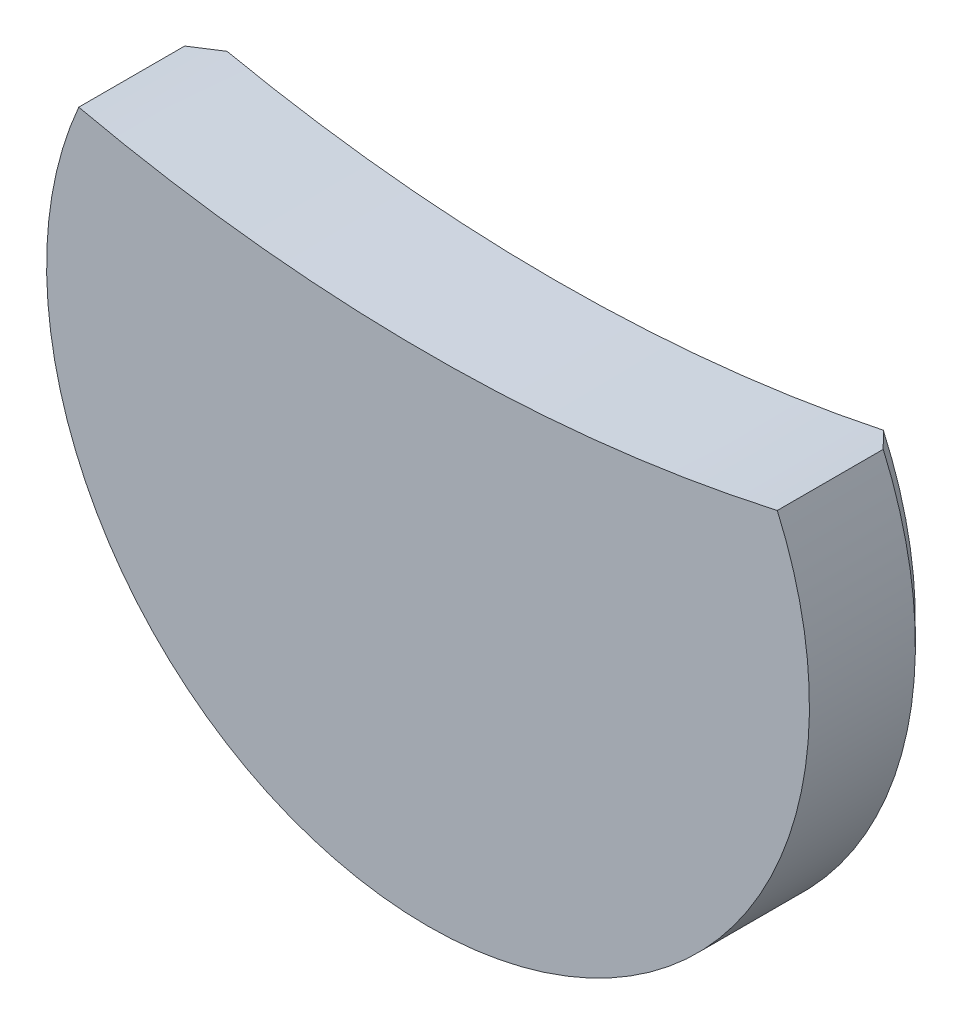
ISO-10303-21;
HEADER;
FILE_DESCRIPTION(('STEP AP214'),'2;1');
FILE_NAME('part.step','',(''),(''),'','','');
FILE_SCHEMA(('AUTOMOTIVE_DESIGN { 1 0 10303 214 1 1 1 1 }'));
ENDSEC;
DATA;
#1=APPLICATION_CONTEXT('core data for automotive mechanical design processes');
#2=APPLICATION_PROTOCOL_DEFINITION('international standard','automotive_design',2000,#1);
#3=PRODUCT_CONTEXT('',#1,'mechanical');
#4=PRODUCT('Part','Part','',(#3));
#5=PRODUCT_RELATED_PRODUCT_CATEGORY('part','',(#4));
#6=PRODUCT_DEFINITION_FORMATION('','',#4);
#7=PRODUCT_DEFINITION_CONTEXT('part definition',#1,'design');
#8=PRODUCT_DEFINITION('design','',#6,#7);
#9=PRODUCT_DEFINITION_SHAPE('','',#8);
#10=(LENGTH_UNIT() NAMED_UNIT(*) SI_UNIT(.MILLI.,.METRE.));
#11=(NAMED_UNIT(*) PLANE_ANGLE_UNIT() SI_UNIT($,.RADIAN.));
#12=(NAMED_UNIT(*) SI_UNIT($,.STERADIAN.) SOLID_ANGLE_UNIT());
#13=UNCERTAINTY_MEASURE_WITH_UNIT(LENGTH_MEASURE(1.E-05),#10,'distance_accuracy_value','');
#14=(GEOMETRIC_REPRESENTATION_CONTEXT(3) GLOBAL_UNCERTAINTY_ASSIGNED_CONTEXT((#13)) GLOBAL_UNIT_ASSIGNED_CONTEXT((#10,
#11,#12)) REPRESENTATION_CONTEXT('',''));
#15=CARTESIAN_POINT('',(0.,0.,0.));
#16=DIRECTION('',(0.,0.,1.));
#17=DIRECTION('',(1.,0.,0.));
#18=AXIS2_PLACEMENT_3D('',#15,#16,#17);
#19=CARTESIAN_POINT('',(0.,40.2,3.));
#20=DIRECTION('',(0.,0.,-1.));
#21=DIRECTION('',(-1.,0.,0.));
#22=AXIS2_PLACEMENT_3D('',#19,#20,#21);
#23=CYLINDRICAL_SURFACE('',#22,37.5);
#24=DIRECTION('',(0.,0.,-1.));
#25=VECTOR('',#24,1.);
#26=CARTESIAN_POINT('',(8.24128767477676,3.6167910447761,3.));
#27=LINE('',#26,#25);
#28=CARTESIAN_POINT('',(8.24128767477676,3.6167910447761,3.));
#29=VERTEX_POINT('',#28);
#30=CARTESIAN_POINT('',(8.24128767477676,3.6167910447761,0.500000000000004));
#31=VERTEX_POINT('',#30);
#32=EDGE_CURVE('E73',#29,#31,#27,.T.);
#33=ORIENTED_EDGE('',*,*,#32,.T.);
#34=CARTESIAN_POINT('',(8.24128767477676,3.6167910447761,0.500000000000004));
#35=CARTESIAN_POINT('',(8.15836495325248,3.59810985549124,0.416554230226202));
#36=CARTESIAN_POINT('',(8.07532670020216,3.57970002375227,0.333164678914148));
#37=CARTESIAN_POINT('',(7.90901913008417,3.5434230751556,0.166498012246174));
#38=CARTESIAN_POINT('',(7.82574981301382,3.52555595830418,0.0832208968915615));
#39=CARTESIAN_POINT('',(7.74236496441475,3.50796019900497,0.));
#40=B_SPLINE_CURVE_WITH_KNOTS('',3,(#34,#35,#36,#37,#38,#39),.UNSPECIFIED.,.F.,.F.,(4,2,4),(0.,
0.357341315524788,0.714682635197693),.UNSPECIFIED.);
#41=CARTESIAN_POINT('',(7.74236496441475,3.50796019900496,0.));
#42=VERTEX_POINT('',#41);
#43=EDGE_CURVE('E42',#31,#42,#40,.T.);
#44=ORIENTED_EDGE('',*,*,#43,.T.);
#45=CARTESIAN_POINT('',(0.,40.2,0.));
#46=DIRECTION('',(0.,0.,-1.));
#47=DIRECTION('',(1.,0.,0.));
#48=AXIS2_PLACEMENT_3D('',#45,#46,#47);
#49=CIRCLE('',#48,37.5);
#50=CARTESIAN_POINT('',(-7.74236496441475,3.50796019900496,0.));
#51=VERTEX_POINT('',#50);
#52=EDGE_CURVE('E79',#42,#51,#49,.T.);
#53=ORIENTED_EDGE('',*,*,#52,.T.);
#54=CARTESIAN_POINT('',(-7.74236496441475,3.50796019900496,0.));
#55=CARTESIAN_POINT('',(-7.82574981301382,3.52555595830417,0.083220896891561));
#56=CARTESIAN_POINT('',(-7.90901913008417,3.54342307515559,0.166498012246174));
#57=CARTESIAN_POINT('',(-8.07532670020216,3.57970002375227,0.333164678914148));
#58=CARTESIAN_POINT('',(-8.15836495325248,3.59810985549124,0.416554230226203));
#59=CARTESIAN_POINT('',(-8.24128767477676,3.61679104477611,0.500000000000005));
#60=B_SPLINE_CURVE_WITH_KNOTS('',3,(#54,#55,#56,#57,#58,#59),.UNSPECIFIED.,.F.,.F.,(4,2,4),(0.,
0.357341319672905,0.714682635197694),.UNSPECIFIED.);
#61=CARTESIAN_POINT('',(-8.24128767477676,3.6167910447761,0.500000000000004));
#62=VERTEX_POINT('',#61);
#63=EDGE_CURVE('E82',#51,#62,#60,.T.);
#64=ORIENTED_EDGE('',*,*,#63,.T.);
#65=DIRECTION('',(0.,0.,-1.));
#66=VECTOR('',#65,1.);
#67=CARTESIAN_POINT('',(-8.24128767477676,3.6167910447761,3.));
#68=LINE('',#67,#66);
#69=CARTESIAN_POINT('',(-8.24128767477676,3.6167910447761,3.));
#70=VERTEX_POINT('',#69);
#71=EDGE_CURVE('E71',#70,#62,#68,.T.);
#72=ORIENTED_EDGE('',*,*,#71,.F.);
#73=CARTESIAN_POINT('',(0.,40.2,3.));
#74=DIRECTION('',(0.,0.,-1.));
#75=DIRECTION('',(1.,0.,0.));
#76=AXIS2_PLACEMENT_3D('',#73,#74,#75);
#77=CIRCLE('',#76,37.5);
#78=EDGE_CURVE('E76',#29,#70,#77,.T.);
#79=ORIENTED_EDGE('',*,*,#78,.F.);
#80=EDGE_LOOP('',(#33,#44,#53,#64,#72,#79));
#81=FACE_BOUND('',#80,.T.);
#82=ADVANCED_FACE('F33',(#81),#23,.F.);
#83=CARTESIAN_POINT('',(0.,0.,3.));
#84=DIRECTION('',(0.,0.,-1.));
#85=DIRECTION('',(-1.,0.,0.));
#86=AXIS2_PLACEMENT_3D('',#83,#84,#85);
#87=CYLINDRICAL_SURFACE('',#86,9.);
#88=ORIENTED_EDGE('',*,*,#71,.T.);
#89=CARTESIAN_POINT('',(0.,0.,0.500000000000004));
#90=DIRECTION('',(0.,0.,1.));
#91=DIRECTION('',(1.,0.,0.));
#92=AXIS2_PLACEMENT_3D('',#89,#90,#91);
#93=CIRCLE('',#92,9.);
#94=EDGE_CURVE('E83',#62,#31,#93,.T.);
#95=ORIENTED_EDGE('',*,*,#94,.T.);
#96=ORIENTED_EDGE('',*,*,#32,.F.);
#97=CARTESIAN_POINT('',(0.,0.,3.));
#98=DIRECTION('',(0.,0.,1.));
#99=DIRECTION('',(1.,0.,0.));
#100=AXIS2_PLACEMENT_3D('',#97,#98,#99);
#101=CIRCLE('',#100,9.);
#102=EDGE_CURVE('E66',#70,#29,#101,.T.);
#103=ORIENTED_EDGE('',*,*,#102,.F.);
#104=EDGE_LOOP('',(#88,#95,#96,#103));
#105=FACE_BOUND('',#104,.T.);
#106=ADVANCED_FACE('F68',(#105),#87,.T.);
#107=CARTESIAN_POINT('',(0.,20.1,3.));
#108=DIRECTION('',(0.,0.,1.));
#109=DIRECTION('',(1.,0.,0.));
#110=AXIS2_PLACEMENT_3D('',#107,#108,#109);
#111=PLANE('',#110);
#112=ORIENTED_EDGE('',*,*,#78,.T.);
#113=ORIENTED_EDGE('',*,*,#102,.T.);
#114=EDGE_LOOP('',(#112,#113));
#115=FACE_BOUND('',#114,.T.);
#116=ADVANCED_FACE('F78',(#115),#111,.T.);
#117=CARTESIAN_POINT('',(0.,20.1,0.));
#118=DIRECTION('',(0.,0.,1.));
#119=DIRECTION('',(1.,0.,0.));
#120=AXIS2_PLACEMENT_3D('',#117,#118,#119);
#121=PLANE('',#120);
#122=ORIENTED_EDGE('',*,*,#52,.F.);
#123=CARTESIAN_POINT('',(0.,0.,0.));
#124=DIRECTION('',(0.,0.,1.));
#125=DIRECTION('',(1.,0.,0.));
#126=AXIS2_PLACEMENT_3D('',#123,#124,#125);
#127=CIRCLE('',#126,8.49999999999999);
#128=EDGE_CURVE('E11',#42,#51,#127,.F.);
#129=ORIENTED_EDGE('',*,*,#128,.T.);
#130=EDGE_LOOP('',(#122,#129));
#131=FACE_BOUND('',#130,.T.);
#132=ADVANCED_FACE('F101',(#131),#121,.F.);
#133=CARTESIAN_POINT('',(0.,0.,0.500000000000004));
#134=DIRECTION('',(0.,0.,1.));
#135=DIRECTION('',(1.,0.,0.));
#136=AXIS2_PLACEMENT_3D('',#133,#134,#135);
#137=CONICAL_SURFACE('',#136,9.,0.785398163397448);
#138=ORIENTED_EDGE('',*,*,#63,.F.);
#139=ORIENTED_EDGE('',*,*,#128,.F.);
#140=ORIENTED_EDGE('',*,*,#43,.F.);
#141=ORIENTED_EDGE('',*,*,#94,.F.);
#142=EDGE_LOOP('',(#138,#139,#140,#141));
#143=FACE_BOUND('',#142,.T.);
#144=ADVANCED_FACE('F35',(#143),#137,.T.);
#145=CLOSED_SHELL('',(#82,#106,#116,#132,#144));
#146=MANIFOLD_SOLID_BREP('B2',#145);
#147=ADVANCED_BREP_SHAPE_REPRESENTATION('',(#18,#146),#14);
#148=SHAPE_DEFINITION_REPRESENTATION(#9,#147);
ENDSEC;
END-ISO-10303-21;
